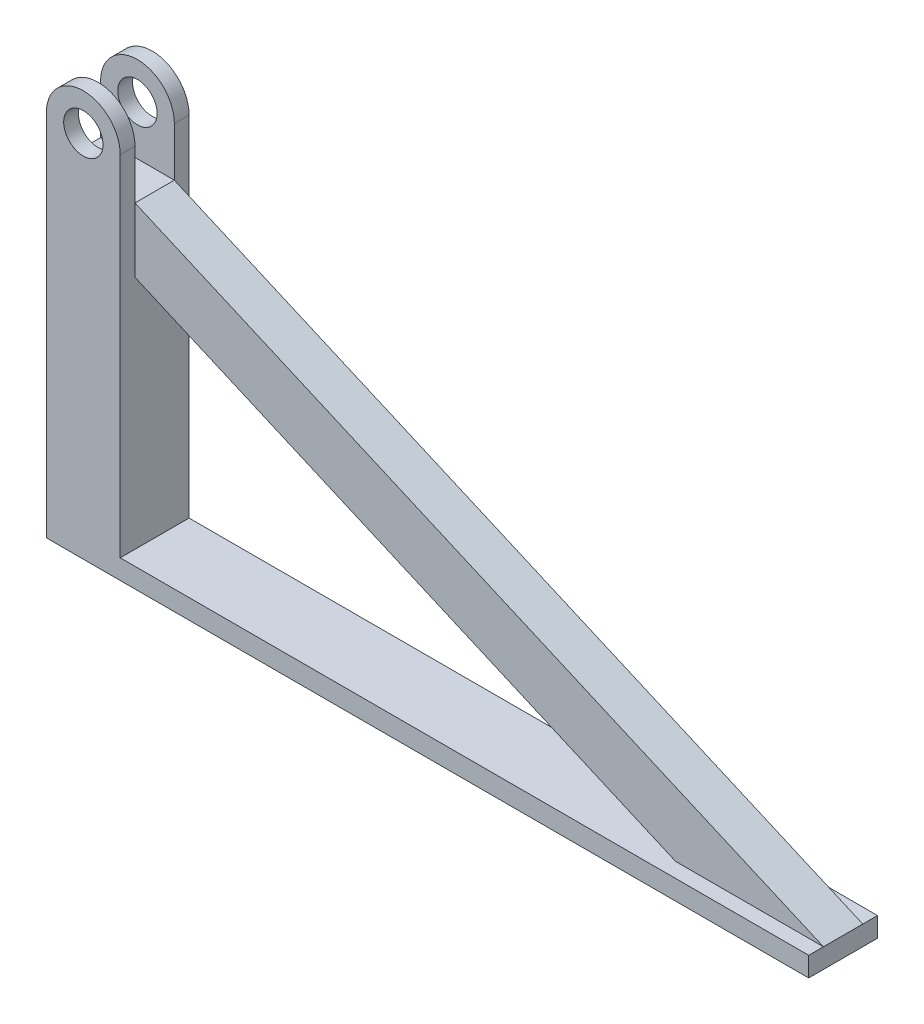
ISO-10303-21;
HEADER;
FILE_DESCRIPTION(('STEP AP214'),'2;1');
FILE_NAME('part.step','',(''),(''),'','','');
FILE_SCHEMA(('AUTOMOTIVE_DESIGN { 1 0 10303 214 1 1 1 1 }'));
ENDSEC;
DATA;
#1=APPLICATION_CONTEXT('core data for automotive mechanical design processes');
#2=APPLICATION_PROTOCOL_DEFINITION('international standard','automotive_design',2000,#1);
#3=PRODUCT_CONTEXT('',#1,'mechanical');
#4=PRODUCT('Part','Part','',(#3));
#5=PRODUCT_RELATED_PRODUCT_CATEGORY('part','',(#4));
#6=PRODUCT_DEFINITION_FORMATION('','',#4);
#7=PRODUCT_DEFINITION_CONTEXT('part definition',#1,'design');
#8=PRODUCT_DEFINITION('design','',#6,#7);
#9=PRODUCT_DEFINITION_SHAPE('','',#8);
#10=(LENGTH_UNIT() NAMED_UNIT(*) SI_UNIT(.MILLI.,.METRE.));
#11=(NAMED_UNIT(*) PLANE_ANGLE_UNIT() SI_UNIT($,.RADIAN.));
#12=(NAMED_UNIT(*) SI_UNIT($,.STERADIAN.) SOLID_ANGLE_UNIT());
#13=UNCERTAINTY_MEASURE_WITH_UNIT(LENGTH_MEASURE(1.E-05),#10,'distance_accuracy_value','');
#14=(GEOMETRIC_REPRESENTATION_CONTEXT(3) GLOBAL_UNCERTAINTY_ASSIGNED_CONTEXT((#13)) GLOBAL_UNIT_ASSIGNED_CONTEXT((#10,
#11,#12)) REPRESENTATION_CONTEXT('',''));
#15=CARTESIAN_POINT('',(0.,0.,0.));
#16=DIRECTION('',(0.,0.,1.));
#17=DIRECTION('',(1.,0.,0.));
#18=AXIS2_PLACEMENT_3D('',#15,#16,#17);
#19=CARTESIAN_POINT('',(0.,0.,-40.));
#20=DIRECTION('',(0.,0.,1.));
#21=DIRECTION('',(1.,0.,0.));
#22=AXIS2_PLACEMENT_3D('',#19,#20,#21);
#23=PLANE('',#22);
#24=DIRECTION('',(0.,-1.,0.));
#25=VECTOR('',#24,1.);
#26=CARTESIAN_POINT('',(-625.,0.,-40.));
#27=LINE('',#26,#25);
#28=CARTESIAN_POINT('',(-625.,650.,-40.));
#29=VERTEX_POINT('',#28);
#30=CARTESIAN_POINT('',(-625.,519.103873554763,-40.));
#31=VERTEX_POINT('',#30);
#32=EDGE_CURVE('E11',#29,#31,#27,.T.);
#33=ORIENTED_EDGE('',*,*,#32,.F.);
#34=DIRECTION('',(0.916757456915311,-0.3994443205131,0.));
#35=VECTOR('',#34,1.);
#36=CARTESIAN_POINT('',(138.303460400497,317.417777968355,-40.));
#37=LINE('',#36,#35);
#38=CARTESIAN_POINT('',(775.,40.,-40.));
#39=VERTEX_POINT('',#38);
#40=EDGE_CURVE('E84',#29,#39,#37,.T.);
#41=ORIENTED_EDGE('',*,*,#40,.T.);
#42=DIRECTION('',(1.,0.,0.));
#43=VECTOR('',#42,1.);
#44=CARTESIAN_POINT('',(0.,40.,-40.));
#45=LINE('',#44,#43);
#46=CARTESIAN_POINT('',(474.58266061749,40.,-40.));
#47=VERTEX_POINT('',#46);
#48=EDGE_CURVE('E52',#47,#39,#45,.T.);
#49=ORIENTED_EDGE('',*,*,#48,.F.);
#50=DIRECTION('',(0.916757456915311,-0.3994443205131,0.));
#51=VECTOR('',#50,1.);
#52=CARTESIAN_POINT('',(90.3701419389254,207.406883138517,-40.));
#53=LINE('',#52,#51);
#54=EDGE_CURVE('E81',#31,#47,#53,.T.);
#55=ORIENTED_EDGE('',*,*,#54,.F.);
#56=EDGE_LOOP('',(#33,#41,#49,#55));
#57=FACE_BOUND('',#56,.T.);
#58=ADVANCED_FACE('F42',(#57),#23,.F.);
#59=CARTESIAN_POINT('',(0.,0.,40.));
#60=DIRECTION('',(0.,0.,1.));
#61=DIRECTION('',(1.,0.,0.));
#62=AXIS2_PLACEMENT_3D('',#59,#60,#61);
#63=PLANE('',#62);
#64=DIRECTION('',(0.916757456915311,-0.3994443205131,0.));
#65=VECTOR('',#64,1.);
#66=CARTESIAN_POINT('',(138.303460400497,317.417777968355,40.));
#67=LINE('',#66,#65);
#68=CARTESIAN_POINT('',(-625.,650.,40.));
#69=VERTEX_POINT('',#68);
#70=CARTESIAN_POINT('',(775.,40.,40.));
#71=VERTEX_POINT('',#70);
#72=EDGE_CURVE('E104',#69,#71,#67,.T.);
#73=ORIENTED_EDGE('',*,*,#72,.F.);
#74=DIRECTION('',(0.,-1.,0.));
#75=VECTOR('',#74,1.);
#76=CARTESIAN_POINT('',(-625.,0.,40.));
#77=LINE('',#76,#75);
#78=CARTESIAN_POINT('',(-625.,519.103873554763,40.));
#79=VERTEX_POINT('',#78);
#80=EDGE_CURVE('E88',#69,#79,#77,.T.);
#81=ORIENTED_EDGE('',*,*,#80,.T.);
#82=DIRECTION('',(0.916757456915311,-0.3994443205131,0.));
#83=VECTOR('',#82,1.);
#84=CARTESIAN_POINT('',(90.3701419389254,207.406883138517,40.));
#85=LINE('',#84,#83);
#86=CARTESIAN_POINT('',(474.58266061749,40.,40.));
#87=VERTEX_POINT('',#86);
#88=EDGE_CURVE('E122',#79,#87,#85,.T.);
#89=ORIENTED_EDGE('',*,*,#88,.T.);
#90=DIRECTION('',(1.,0.,0.));
#91=VECTOR('',#90,1.);
#92=CARTESIAN_POINT('',(0.,40.,40.));
#93=LINE('',#92,#91);
#94=EDGE_CURVE('E94',#87,#71,#93,.T.);
#95=ORIENTED_EDGE('',*,*,#94,.T.);
#96=EDGE_LOOP('',(#73,#81,#89,#95));
#97=FACE_BOUND('',#96,.T.);
#98=ADVANCED_FACE('F141',(#97),#63,.T.);
#99=CARTESIAN_POINT('',(-700.,-5.,0.));
#100=DIRECTION('',(0.,1.,0.));
#101=DIRECTION('',(0.,0.,1.));
#102=AXIS2_PLACEMENT_3D('',#99,#100,#101);
#103=CYLINDRICAL_SURFACE('',#102,20.);
#104=CARTESIAN_POINT('',(-700.,-5.,0.));
#105=DIRECTION('',(0.,1.,0.));
#106=DIRECTION('',(0.,0.,1.));
#107=AXIS2_PLACEMENT_3D('',#104,#105,#106);
#108=CIRCLE('',#107,20.);
#109=CARTESIAN_POINT('',(-700.,-5.,20.0000000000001));
#110=VERTEX_POINT('',#109);
#111=EDGE_CURVE('E131',#110,#110,#108,.T.);
#112=ORIENTED_EDGE('',*,*,#111,.T.);
#113=EDGE_LOOP('',(#112));
#114=FACE_BOUND('',#113,.T.);
#115=CARTESIAN_POINT('',(-700.,0.,0.));
#116=DIRECTION('',(0.,1.,0.));
#117=DIRECTION('',(0.,0.,1.));
#118=AXIS2_PLACEMENT_3D('',#115,#116,#117);
#119=CIRCLE('',#118,20.);
#120=CARTESIAN_POINT('',(-700.,0.,20.0000000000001));
#121=VERTEX_POINT('',#120);
#122=EDGE_CURVE('E98',#121,#121,#119,.T.);
#123=ORIENTED_EDGE('',*,*,#122,.F.);
#124=EDGE_LOOP('',(#123));
#125=FACE_BOUND('',#124,.T.);
#126=ADVANCED_FACE('F44',(#114,#125),#103,.T.);
#127=CARTESIAN_POINT('',(-700.,-5.,0.));
#128=DIRECTION('',(0.,1.,0.));
#129=DIRECTION('',(0.,0.,1.));
#130=AXIS2_PLACEMENT_3D('',#127,#128,#129);
#131=PLANE('',#130);
#132=ORIENTED_EDGE('',*,*,#111,.F.);
#133=EDGE_LOOP('',(#132));
#134=FACE_BOUND('',#133,.T.);
#135=ADVANCED_FACE('F140',(#134),#131,.F.);
#136=CARTESIAN_POINT('',(90.3701419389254,207.406883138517,40.));
#137=DIRECTION('',(0.399444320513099,0.916757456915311,0.));
#138=DIRECTION('',(-0.916757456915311,0.399444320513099,0.));
#139=AXIS2_PLACEMENT_3D('',#136,#137,#138);
#140=PLANE('',#139);
#141=ORIENTED_EDGE('',*,*,#54,.T.);
#142=DIRECTION('',(0.,0.,-1.));
#143=VECTOR('',#142,1.);
#144=CARTESIAN_POINT('',(474.58266061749,40.,40.));
#145=LINE('',#144,#143);
#146=EDGE_CURVE('E91',#87,#47,#145,.T.);
#147=ORIENTED_EDGE('',*,*,#146,.F.);
#148=ORIENTED_EDGE('',*,*,#88,.F.);
#149=DIRECTION('',(0.,0.,-1.));
#150=VECTOR('',#149,1.);
#151=CARTESIAN_POINT('',(-625.,519.103873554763,40.));
#152=LINE('',#151,#150);
#153=EDGE_CURVE('E103',#79,#31,#152,.T.);
#154=ORIENTED_EDGE('',*,*,#153,.T.);
#155=EDGE_LOOP('',(#141,#147,#148,#154));
#156=FACE_BOUND('',#155,.T.);
#157=ADVANCED_FACE('F101',(#156),#140,.F.);
#158=CARTESIAN_POINT('',(0.,40.,40.));
#159=DIRECTION('',(0.,1.,0.));
#160=DIRECTION('',(0.,0.,1.));
#161=AXIS2_PLACEMENT_3D('',#158,#159,#160);
#162=PLANE('',#161);
#163=ORIENTED_EDGE('',*,*,#146,.T.);
#164=ORIENTED_EDGE('',*,*,#48,.T.);
#165=DIRECTION('',(0.,0.,1.));
#166=VECTOR('',#165,1.);
#167=CARTESIAN_POINT('',(775.,40.,-70.));
#168=LINE('',#167,#166);
#169=CARTESIAN_POINT('',(775.,40.,-70.));
#170=VERTEX_POINT('',#169);
#171=EDGE_CURVE('E235',#170,#39,#168,.T.);
#172=ORIENTED_EDGE('',*,*,#171,.F.);
#173=DIRECTION('',(1.,0.,0.));
#174=VECTOR('',#173,1.);
#175=CARTESIAN_POINT('',(0.,40.,-70.));
#176=LINE('',#175,#174);
#177=CARTESIAN_POINT('',(-625.,40.,-70.));
#178=VERTEX_POINT('',#177);
#179=EDGE_CURVE('E210',#178,#170,#176,.T.);
#180=ORIENTED_EDGE('',*,*,#179,.F.);
#181=DIRECTION('',(0.,0.,-1.));
#182=VECTOR('',#181,1.);
#183=CARTESIAN_POINT('',(-625.,40.,40.));
#184=LINE('',#183,#182);
#185=CARTESIAN_POINT('',(-625.,40.,70.));
#186=VERTEX_POINT('',#185);
#187=EDGE_CURVE('E99',#186,#178,#184,.T.);
#188=ORIENTED_EDGE('',*,*,#187,.F.);
#189=DIRECTION('',(1.,0.,0.));
#190=VECTOR('',#189,1.);
#191=CARTESIAN_POINT('',(0.,40.,70.));
#192=LINE('',#191,#190);
#193=CARTESIAN_POINT('',(775.,40.,70.));
#194=VERTEX_POINT('',#193);
#195=EDGE_CURVE('E256',#186,#194,#192,.T.);
#196=ORIENTED_EDGE('',*,*,#195,.T.);
#197=DIRECTION('',(0.,0.,-1.));
#198=VECTOR('',#197,1.);
#199=CARTESIAN_POINT('',(775.,40.,70.));
#200=LINE('',#199,#198);
#201=EDGE_CURVE('E61',#194,#71,#200,.T.);
#202=ORIENTED_EDGE('',*,*,#201,.T.);
#203=ORIENTED_EDGE('',*,*,#94,.F.);
#204=EDGE_LOOP('',(#163,#164,#172,#180,#188,#196,#202,#203));
#205=FACE_BOUND('',#204,.T.);
#206=ADVANCED_FACE('F92',(#205),#162,.T.);
#207=CARTESIAN_POINT('',(775.,0.,40.));
#208=DIRECTION('',(1.,0.,0.));
#209=DIRECTION('',(0.,0.,-1.));
#210=AXIS2_PLACEMENT_3D('',#207,#208,#209);
#211=PLANE('',#210);
#212=DIRECTION('',(0.,0.,-1.));
#213=VECTOR('',#212,1.);
#214=CARTESIAN_POINT('',(775.,2.52506029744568E-13,40.));
#215=LINE('',#214,#213);
#216=CARTESIAN_POINT('',(775.,2.52506029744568E-13,70.));
#217=VERTEX_POINT('',#216);
#218=CARTESIAN_POINT('',(775.,2.52506029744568E-13,-70.));
#219=VERTEX_POINT('',#218);
#220=EDGE_CURVE('E118',#217,#219,#215,.T.);
#221=ORIENTED_EDGE('',*,*,#220,.T.);
#222=DIRECTION('',(0.,-1.,0.));
#223=VECTOR('',#222,1.);
#224=CARTESIAN_POINT('',(775.,0.,-70.));
#225=LINE('',#224,#223);
#226=EDGE_CURVE('E191',#170,#219,#225,.T.);
#227=ORIENTED_EDGE('',*,*,#226,.F.);
#228=ORIENTED_EDGE('',*,*,#171,.T.);
#229=DIRECTION('',(0.,0.,-1.));
#230=VECTOR('',#229,1.);
#231=CARTESIAN_POINT('',(775.,40.,40.));
#232=LINE('',#231,#230);
#233=EDGE_CURVE('E115',#71,#39,#232,.T.);
#234=ORIENTED_EDGE('',*,*,#233,.F.);
#235=ORIENTED_EDGE('',*,*,#201,.F.);
#236=DIRECTION('',(0.,-1.,0.));
#237=VECTOR('',#236,1.);
#238=CARTESIAN_POINT('',(775.,0.,70.));
#239=LINE('',#238,#237);
#240=EDGE_CURVE('E194',#194,#217,#239,.T.);
#241=ORIENTED_EDGE('',*,*,#240,.T.);
#242=EDGE_LOOP('',(#221,#227,#228,#234,#235,#241));
#243=FACE_BOUND('',#242,.T.);
#244=ADVANCED_FACE('F163',(#243),#211,.T.);
#245=CARTESIAN_POINT('',(138.303460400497,317.417777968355,40.));
#246=DIRECTION('',(0.3994443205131,0.916757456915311,0.));
#247=DIRECTION('',(-0.916757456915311,0.3994443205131,0.));
#248=AXIS2_PLACEMENT_3D('',#245,#246,#247);
#249=PLANE('',#248);
#250=ORIENTED_EDGE('',*,*,#40,.F.);
#251=DIRECTION('',(0.,0.,-1.));
#252=VECTOR('',#251,1.);
#253=CARTESIAN_POINT('',(-625.,650.,40.));
#254=LINE('',#253,#252);
#255=EDGE_CURVE('E127',#69,#29,#254,.T.);
#256=ORIENTED_EDGE('',*,*,#255,.F.);
#257=ORIENTED_EDGE('',*,*,#72,.T.);
#258=ORIENTED_EDGE('',*,*,#233,.T.);
#259=EDGE_LOOP('',(#250,#256,#257,#258));
#260=FACE_BOUND('',#259,.T.);
#261=ADVANCED_FACE('F176',(#260),#249,.T.);
#262=CARTESIAN_POINT('',(0.,650.,40.));
#263=DIRECTION('',(0.,1.,0.));
#264=DIRECTION('',(0.,0.,1.));
#265=AXIS2_PLACEMENT_3D('',#262,#263,#264);
#266=PLANE('',#265);
#267=DIRECTION('',(1.,0.,0.));
#268=VECTOR('',#267,1.);
#269=CARTESIAN_POINT('',(0.,650.,-40.));
#270=LINE('',#269,#268);
#271=CARTESIAN_POINT('',(-775.,650.,-40.));
#272=VERTEX_POINT('',#271);
#273=EDGE_CURVE('E105',#272,#29,#270,.T.);
#274=ORIENTED_EDGE('',*,*,#273,.F.);
#275=DIRECTION('',(0.,0.,-1.));
#276=VECTOR('',#275,1.);
#277=CARTESIAN_POINT('',(-775.,650.,40.));
#278=LINE('',#277,#276);
#279=CARTESIAN_POINT('',(-775.,650.,40.));
#280=VERTEX_POINT('',#279);
#281=EDGE_CURVE('E125',#280,#272,#278,.T.);
#282=ORIENTED_EDGE('',*,*,#281,.F.);
#283=DIRECTION('',(1.,0.,0.));
#284=VECTOR('',#283,1.);
#285=CARTESIAN_POINT('',(0.,650.,40.));
#286=LINE('',#285,#284);
#287=EDGE_CURVE('E108',#280,#69,#286,.T.);
#288=ORIENTED_EDGE('',*,*,#287,.T.);
#289=ORIENTED_EDGE('',*,*,#255,.T.);
#290=EDGE_LOOP('',(#274,#282,#288,#289));
#291=FACE_BOUND('',#290,.T.);
#292=ADVANCED_FACE('F172',(#291),#266,.T.);
#293=CARTESIAN_POINT('',(-775.,-1.14723045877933E-13,40.));
#294=DIRECTION('',(1.,0.,0.));
#295=DIRECTION('',(0.,1.,0.));
#296=AXIS2_PLACEMENT_3D('',#293,#294,#295);
#297=PLANE('',#296);
#298=ORIENTED_EDGE('',*,*,#281,.T.);
#299=DIRECTION('',(0.,-1.,0.));
#300=VECTOR('',#299,1.);
#301=CARTESIAN_POINT('',(-775.,-1.14723045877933E-13,-40.));
#302=LINE('',#301,#300);
#303=CARTESIAN_POINT('',(-775.,750.,-40.));
#304=VERTEX_POINT('',#303);
#305=EDGE_CURVE('E228',#304,#272,#302,.T.);
#306=ORIENTED_EDGE('',*,*,#305,.F.);
#307=DIRECTION('',(0.,0.,1.));
#308=VECTOR('',#307,1.);
#309=CARTESIAN_POINT('',(-775.,750.,-70.));
#310=LINE('',#309,#308);
#311=CARTESIAN_POINT('',(-775.,750.,-70.));
#312=VERTEX_POINT('',#311);
#313=EDGE_CURVE('E238',#312,#304,#310,.T.);
#314=ORIENTED_EDGE('',*,*,#313,.F.);
#315=DIRECTION('',(0.,-1.,0.));
#316=VECTOR('',#315,1.);
#317=CARTESIAN_POINT('',(-775.,-1.14723045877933E-13,-70.));
#318=LINE('',#317,#316);
#319=CARTESIAN_POINT('',(-775.,-2.22044604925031E-13,-70.));
#320=VERTEX_POINT('',#319);
#321=EDGE_CURVE('E213',#312,#320,#318,.T.);
#322=ORIENTED_EDGE('',*,*,#321,.T.);
#323=DIRECTION('',(0.,0.,-1.));
#324=VECTOR('',#323,1.);
#325=CARTESIAN_POINT('',(-775.,-2.22044604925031E-13,40.));
#326=LINE('',#325,#324);
#327=CARTESIAN_POINT('',(-775.,-2.22044604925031E-13,70.));
#328=VERTEX_POINT('',#327);
#329=EDGE_CURVE('E121',#328,#320,#326,.T.);
#330=ORIENTED_EDGE('',*,*,#329,.F.);
#331=DIRECTION('',(0.,-1.,0.));
#332=VECTOR('',#331,1.);
#333=CARTESIAN_POINT('',(-775.,-1.14723045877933E-13,70.));
#334=LINE('',#333,#332);
#335=CARTESIAN_POINT('',(-775.,750.,70.));
#336=VERTEX_POINT('',#335);
#337=EDGE_CURVE('E250',#336,#328,#334,.T.);
#338=ORIENTED_EDGE('',*,*,#337,.F.);
#339=DIRECTION('',(0.,0.,-1.));
#340=VECTOR('',#339,1.);
#341=CARTESIAN_POINT('',(-775.,750.,70.));
#342=LINE('',#341,#340);
#343=CARTESIAN_POINT('',(-775.,750.,40.));
#344=VERTEX_POINT('',#343);
#345=EDGE_CURVE('E273',#336,#344,#342,.T.);
#346=ORIENTED_EDGE('',*,*,#345,.T.);
#347=DIRECTION('',(0.,-1.,0.));
#348=VECTOR('',#347,1.);
#349=CARTESIAN_POINT('',(-775.,-1.14723045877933E-13,40.));
#350=LINE('',#349,#348);
#351=EDGE_CURVE('E266',#344,#280,#350,.T.);
#352=ORIENTED_EDGE('',*,*,#351,.T.);
#353=EDGE_LOOP('',(#298,#306,#314,#322,#330,#338,#346,#352));
#354=FACE_BOUND('',#353,.T.);
#355=ADVANCED_FACE('F168',(#354),#297,.F.);
#356=CARTESIAN_POINT('',(0.,0.,40.));
#357=DIRECTION('',(0.,-1.,0.));
#358=DIRECTION('',(1.,0.,0.));
#359=AXIS2_PLACEMENT_3D('',#356,#357,#358);
#360=PLANE('',#359);
#361=CARTESIAN_POINT('',(700.,2.29850860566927E-13,-3.34328576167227E-13));
#362=DIRECTION('',(0.,-1.,0.));
#363=DIRECTION('',(1.,0.,0.));
#364=AXIS2_PLACEMENT_3D('',#361,#362,#363);
#365=CIRCLE('',#364,20.);
#366=CARTESIAN_POINT('',(720.,2.35974094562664E-13,-3.34328576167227E-13));
#367=VERTEX_POINT('',#366);
#368=EDGE_CURVE('E46',#367,#367,#365,.T.);
#369=ORIENTED_EDGE('',*,*,#368,.F.);
#370=EDGE_LOOP('',(#369));
#371=FACE_BOUND('',#370,.T.);
#372=ORIENTED_EDGE('',*,*,#122,.T.);
#373=EDGE_LOOP('',(#372));
#374=FACE_BOUND('',#373,.T.);
#375=ORIENTED_EDGE('',*,*,#329,.T.);
#376=DIRECTION('',(-1.,0.,0.));
#377=VECTOR('',#376,1.);
#378=CARTESIAN_POINT('',(0.,0.,-70.));
#379=LINE('',#378,#377);
#380=EDGE_CURVE('E207',#219,#320,#379,.T.);
#381=ORIENTED_EDGE('',*,*,#380,.F.);
#382=ORIENTED_EDGE('',*,*,#220,.F.);
#383=DIRECTION('',(-1.,0.,0.));
#384=VECTOR('',#383,1.);
#385=CARTESIAN_POINT('',(0.,0.,70.));
#386=LINE('',#385,#384);
#387=EDGE_CURVE('E253',#217,#328,#386,.T.);
#388=ORIENTED_EDGE('',*,*,#387,.T.);
#389=EDGE_LOOP('',(#375,#381,#382,#388));
#390=FACE_BOUND('',#389,.T.);
#391=ADVANCED_FACE('F136',(#371,#374,#390),#360,.T.);
#392=CARTESIAN_POINT('',(-625.,0.,40.));
#393=DIRECTION('',(1.,0.,0.));
#394=DIRECTION('',(0.,1.,0.));
#395=AXIS2_PLACEMENT_3D('',#392,#393,#394);
#396=PLANE('',#395);
#397=ORIENTED_EDGE('',*,*,#187,.T.);
#398=DIRECTION('',(0.,-1.,0.));
#399=VECTOR('',#398,1.);
#400=CARTESIAN_POINT('',(-625.,0.,-70.));
#401=LINE('',#400,#399);
#402=CARTESIAN_POINT('',(-625.,750.,-70.));
#403=VERTEX_POINT('',#402);
#404=EDGE_CURVE('E234',#403,#178,#401,.T.);
#405=ORIENTED_EDGE('',*,*,#404,.F.);
#406=DIRECTION('',(0.,0.,1.));
#407=VECTOR('',#406,1.);
#408=CARTESIAN_POINT('',(-625.,750.,-70.));
#409=LINE('',#408,#407);
#410=CARTESIAN_POINT('',(-625.,750.,-40.));
#411=VERTEX_POINT('',#410);
#412=EDGE_CURVE('E222',#403,#411,#409,.T.);
#413=ORIENTED_EDGE('',*,*,#412,.T.);
#414=EDGE_CURVE('E54',#411,#29,#27,.T.);
#415=ORIENTED_EDGE('',*,*,#414,.T.);
#416=ORIENTED_EDGE('',*,*,#32,.T.);
#417=ORIENTED_EDGE('',*,*,#153,.F.);
#418=ORIENTED_EDGE('',*,*,#80,.F.);
#419=CARTESIAN_POINT('',(-625.,750.,40.));
#420=VERTEX_POINT('',#419);
#421=EDGE_CURVE('E237',#420,#69,#77,.T.);
#422=ORIENTED_EDGE('',*,*,#421,.F.);
#423=DIRECTION('',(0.,0.,-1.));
#424=VECTOR('',#423,1.);
#425=CARTESIAN_POINT('',(-625.,750.,70.));
#426=LINE('',#425,#424);
#427=CARTESIAN_POINT('',(-625.,750.,70.));
#428=VERTEX_POINT('',#427);
#429=EDGE_CURVE('E276',#428,#420,#426,.T.);
#430=ORIENTED_EDGE('',*,*,#429,.F.);
#431=DIRECTION('',(0.,-1.,0.));
#432=VECTOR('',#431,1.);
#433=CARTESIAN_POINT('',(-625.,0.,70.));
#434=LINE('',#433,#432);
#435=EDGE_CURVE('E243',#428,#186,#434,.T.);
#436=ORIENTED_EDGE('',*,*,#435,.T.);
#437=EDGE_LOOP('',(#397,#405,#413,#415,#416,#417,#418,#422,#430,#436));
#438=FACE_BOUND('',#437,.T.);
#439=ADVANCED_FACE('F156',(#438),#396,.T.);
#440=CARTESIAN_POINT('',(700.,-5.,-3.34328576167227E-13));
#441=DIRECTION('',(0.,1.,0.));
#442=DIRECTION('',(0.,0.,1.));
#443=AXIS2_PLACEMENT_3D('',#440,#441,#442);
#444=CYLINDRICAL_SURFACE('',#443,20.);
#445=CARTESIAN_POINT('',(700.,-5.,-3.34328576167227E-13));
#446=DIRECTION('',(0.,1.,0.));
#447=DIRECTION('',(0.,0.,1.));
#448=AXIS2_PLACEMENT_3D('',#445,#446,#447);
#449=CIRCLE('',#448,20.);
#450=CARTESIAN_POINT('',(700.,-5.,19.9999999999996));
#451=VERTEX_POINT('',#450);
#452=EDGE_CURVE('E279',#451,#451,#449,.T.);
#453=ORIENTED_EDGE('',*,*,#452,.T.);
#454=EDGE_LOOP('',(#453));
#455=FACE_BOUND('',#454,.T.);
#456=ORIENTED_EDGE('',*,*,#368,.T.);
#457=EDGE_LOOP('',(#456));
#458=FACE_BOUND('',#457,.T.);
#459=ADVANCED_FACE('F159',(#455,#458),#444,.T.);
#460=CARTESIAN_POINT('',(700.,-5.,-3.34328576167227E-13));
#461=DIRECTION('',(0.,1.,0.));
#462=DIRECTION('',(0.,0.,1.));
#463=AXIS2_PLACEMENT_3D('',#460,#461,#462);
#464=PLANE('',#463);
#465=ORIENTED_EDGE('',*,*,#452,.F.);
#466=EDGE_LOOP('',(#465));
#467=FACE_BOUND('',#466,.T.);
#468=ADVANCED_FACE('F358',(#467),#464,.F.);
#469=CARTESIAN_POINT('',(-700.,750.,70.));
#470=DIRECTION('',(0.,0.,-1.));
#471=DIRECTION('',(-1.,0.,0.));
#472=AXIS2_PLACEMENT_3D('',#469,#470,#471);
#473=CYLINDRICAL_SURFACE('',#472,75.);
#474=CARTESIAN_POINT('',(-700.,750.,40.));
#475=DIRECTION('',(0.,0.,1.));
#476=DIRECTION('',(1.,0.,0.));
#477=AXIS2_PLACEMENT_3D('',#474,#475,#476);
#478=CIRCLE('',#477,75.);
#479=EDGE_CURVE('E263',#420,#344,#478,.T.);
#480=ORIENTED_EDGE('',*,*,#479,.T.);
#481=ORIENTED_EDGE('',*,*,#345,.F.);
#482=CARTESIAN_POINT('',(-700.,750.,70.));
#483=DIRECTION('',(0.,0.,1.));
#484=DIRECTION('',(1.,0.,0.));
#485=AXIS2_PLACEMENT_3D('',#482,#483,#484);
#486=CIRCLE('',#485,75.);
#487=EDGE_CURVE('E246',#428,#336,#486,.T.);
#488=ORIENTED_EDGE('',*,*,#487,.F.);
#489=ORIENTED_EDGE('',*,*,#429,.T.);
#490=EDGE_LOOP('',(#480,#481,#488,#489));
#491=FACE_BOUND('',#490,.T.);
#492=ADVANCED_FACE('F355',(#491),#473,.T.);
#493=CARTESIAN_POINT('',(-700.,750.,70.));
#494=DIRECTION('',(0.,0.,-1.));
#495=DIRECTION('',(-1.,0.,0.));
#496=AXIS2_PLACEMENT_3D('',#493,#494,#495);
#497=CYLINDRICAL_SURFACE('',#496,40.);
#498=CARTESIAN_POINT('',(-700.,750.,70.));
#499=DIRECTION('',(0.,0.,1.));
#500=DIRECTION('',(1.,0.,0.));
#501=AXIS2_PLACEMENT_3D('',#498,#499,#500);
#502=CIRCLE('',#501,40.);
#503=CARTESIAN_POINT('',(-660.,750.,70.));
#504=VERTEX_POINT('',#503);
#505=EDGE_CURVE('E258',#504,#504,#502,.T.);
#506=ORIENTED_EDGE('',*,*,#505,.T.);
#507=EDGE_LOOP('',(#506));
#508=FACE_BOUND('',#507,.T.);
#509=CARTESIAN_POINT('',(-700.,750.,40.));
#510=DIRECTION('',(0.,0.,1.));
#511=DIRECTION('',(1.,0.,0.));
#512=AXIS2_PLACEMENT_3D('',#509,#510,#511);
#513=CIRCLE('',#512,40.);
#514=CARTESIAN_POINT('',(-660.,750.,40.));
#515=VERTEX_POINT('',#514);
#516=EDGE_CURVE('E247',#515,#515,#513,.T.);
#517=ORIENTED_EDGE('',*,*,#516,.F.);
#518=EDGE_LOOP('',(#517));
#519=FACE_BOUND('',#518,.T.);
#520=ADVANCED_FACE('F357',(#508,#519),#497,.F.);
#521=CARTESIAN_POINT('',(0.,0.,70.));
#522=DIRECTION('',(0.,0.,1.));
#523=DIRECTION('',(1.,0.,0.));
#524=AXIS2_PLACEMENT_3D('',#521,#522,#523);
#525=PLANE('',#524);
#526=ORIENTED_EDGE('',*,*,#435,.F.);
#527=ORIENTED_EDGE('',*,*,#487,.T.);
#528=ORIENTED_EDGE('',*,*,#337,.T.);
#529=ORIENTED_EDGE('',*,*,#387,.F.);
#530=ORIENTED_EDGE('',*,*,#240,.F.);
#531=ORIENTED_EDGE('',*,*,#195,.F.);
#532=EDGE_LOOP('',(#526,#527,#528,#529,#530,#531));
#533=FACE_BOUND('',#532,.T.);
#534=ORIENTED_EDGE('',*,*,#505,.F.);
#535=EDGE_LOOP('',(#534));
#536=FACE_BOUND('',#535,.T.);
#537=ADVANCED_FACE('F346',(#533,#536),#525,.T.);
#538=CARTESIAN_POINT('',(0.,0.,40.));
#539=DIRECTION('',(0.,0.,1.));
#540=DIRECTION('',(1.,0.,0.));
#541=AXIS2_PLACEMENT_3D('',#538,#539,#540);
#542=PLANE('',#541);
#543=ORIENTED_EDGE('',*,*,#287,.F.);
#544=ORIENTED_EDGE('',*,*,#351,.F.);
#545=ORIENTED_EDGE('',*,*,#479,.F.);
#546=ORIENTED_EDGE('',*,*,#421,.T.);
#547=EDGE_LOOP('',(#543,#544,#545,#546));
#548=FACE_BOUND('',#547,.T.);
#549=ORIENTED_EDGE('',*,*,#516,.T.);
#550=EDGE_LOOP('',(#549));
#551=FACE_BOUND('',#550,.T.);
#552=ADVANCED_FACE('F353',(#548,#551),#542,.F.);
#553=CARTESIAN_POINT('',(-700.,750.,-70.));
#554=DIRECTION('',(0.,0.,1.));
#555=DIRECTION('',(1.,0.,0.));
#556=AXIS2_PLACEMENT_3D('',#553,#554,#555);
#557=CYLINDRICAL_SURFACE('',#556,75.);
#558=CARTESIAN_POINT('',(-700.,750.,-40.));
#559=DIRECTION('',(0.,0.,1.));
#560=DIRECTION('',(1.,0.,0.));
#561=AXIS2_PLACEMENT_3D('',#558,#559,#560);
#562=CIRCLE('',#561,75.);
#563=EDGE_CURVE('E225',#411,#304,#562,.T.);
#564=ORIENTED_EDGE('',*,*,#563,.F.);
#565=ORIENTED_EDGE('',*,*,#412,.F.);
#566=CARTESIAN_POINT('',(-700.,750.,-70.));
#567=DIRECTION('',(0.,0.,1.));
#568=DIRECTION('',(1.,0.,0.));
#569=AXIS2_PLACEMENT_3D('',#566,#567,#568);
#570=CIRCLE('',#569,75.);
#571=EDGE_CURVE('E215',#403,#312,#570,.T.);
#572=ORIENTED_EDGE('',*,*,#571,.T.);
#573=ORIENTED_EDGE('',*,*,#313,.T.);
#574=EDGE_LOOP('',(#564,#565,#572,#573));
#575=FACE_BOUND('',#574,.T.);
#576=ADVANCED_FACE('F328',(#575),#557,.T.);
#577=CARTESIAN_POINT('',(-700.,750.,-70.));
#578=DIRECTION('',(0.,0.,1.));
#579=DIRECTION('',(1.,0.,0.));
#580=AXIS2_PLACEMENT_3D('',#577,#578,#579);
#581=CYLINDRICAL_SURFACE('',#580,40.);
#582=CARTESIAN_POINT('',(-700.,750.,-70.));
#583=DIRECTION('',(0.,0.,1.));
#584=DIRECTION('',(1.,0.,0.));
#585=AXIS2_PLACEMENT_3D('',#582,#583,#584);
#586=CIRCLE('',#585,40.);
#587=CARTESIAN_POINT('',(-660.,750.,-70.));
#588=VERTEX_POINT('',#587);
#589=EDGE_CURVE('E220',#588,#588,#586,.T.);
#590=ORIENTED_EDGE('',*,*,#589,.F.);
#591=EDGE_LOOP('',(#590));
#592=FACE_BOUND('',#591,.T.);
#593=CARTESIAN_POINT('',(-700.,750.,-40.));
#594=DIRECTION('',(0.,0.,1.));
#595=DIRECTION('',(1.,0.,0.));
#596=AXIS2_PLACEMENT_3D('',#593,#594,#595);
#597=CIRCLE('',#596,40.);
#598=CARTESIAN_POINT('',(-660.,750.,-40.));
#599=VERTEX_POINT('',#598);
#600=EDGE_CURVE('E230',#599,#599,#597,.T.);
#601=ORIENTED_EDGE('',*,*,#600,.T.);
#602=EDGE_LOOP('',(#601));
#603=FACE_BOUND('',#602,.T.);
#604=ADVANCED_FACE('F493',(#592,#603),#581,.F.);
#605=CARTESIAN_POINT('',(0.,0.,-70.));
#606=DIRECTION('',(0.,0.,1.));
#607=DIRECTION('',(1.,0.,0.));
#608=AXIS2_PLACEMENT_3D('',#605,#606,#607);
#609=PLANE('',#608);
#610=ORIENTED_EDGE('',*,*,#404,.T.);
#611=ORIENTED_EDGE('',*,*,#179,.T.);
#612=ORIENTED_EDGE('',*,*,#226,.T.);
#613=ORIENTED_EDGE('',*,*,#380,.T.);
#614=ORIENTED_EDGE('',*,*,#321,.F.);
#615=ORIENTED_EDGE('',*,*,#571,.F.);
#616=EDGE_LOOP('',(#610,#611,#612,#613,#614,#615));
#617=FACE_BOUND('',#616,.T.);
#618=ORIENTED_EDGE('',*,*,#589,.T.);
#619=EDGE_LOOP('',(#618));
#620=FACE_BOUND('',#619,.T.);
#621=ADVANCED_FACE('F204',(#617,#620),#609,.F.);
#622=CARTESIAN_POINT('',(0.,0.,-40.));
#623=DIRECTION('',(0.,0.,1.));
#624=DIRECTION('',(1.,0.,0.));
#625=AXIS2_PLACEMENT_3D('',#622,#623,#624);
#626=PLANE('',#625);
#627=ORIENTED_EDGE('',*,*,#305,.T.);
#628=ORIENTED_EDGE('',*,*,#273,.T.);
#629=ORIENTED_EDGE('',*,*,#414,.F.);
#630=ORIENTED_EDGE('',*,*,#563,.T.);
#631=EDGE_LOOP('',(#627,#628,#629,#630));
#632=FACE_BOUND('',#631,.T.);
#633=ORIENTED_EDGE('',*,*,#600,.F.);
#634=EDGE_LOOP('',(#633));
#635=FACE_BOUND('',#634,.T.);
#636=ADVANCED_FACE('F337',(#632,#635),#626,.T.);
#637=CLOSED_SHELL('',(#58,#98,#126,#135,#157,#206,#244,#261,#292,#355,#391,#439,#459,#468,#492,
#520,#537,#552,#576,#604,#621,#636));
#638=MANIFOLD_SOLID_BREP('B2',#637);
#639=ADVANCED_BREP_SHAPE_REPRESENTATION('',(#18,#638),#14);
#640=SHAPE_DEFINITION_REPRESENTATION(#9,#639);
ENDSEC;
END-ISO-10303-21;
